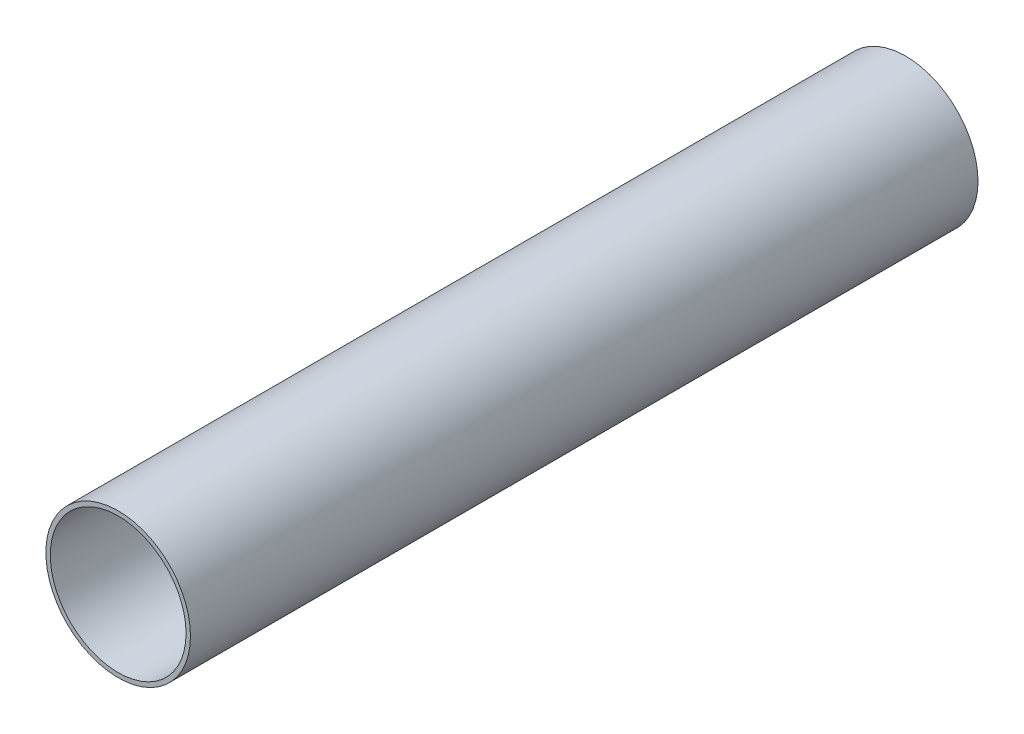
from build123d import *

# Parameters (mm, degrees)
SKETCH1_R      = 27.051
SKETCH1_R_2    = 25.4
EXTRUDE1_DEPTH = 294.64


with BuildPart() as part:
    # Sketch1 → Extrude1 (new body)
    with BuildSketch(Plane.XY):
        Circle(SKETCH1_R)
        Circle(SKETCH1_R_2, mode=Mode.SUBTRACT)
    extrude(amount=EXTRUDE1_DEPTH)


solid = part.part
